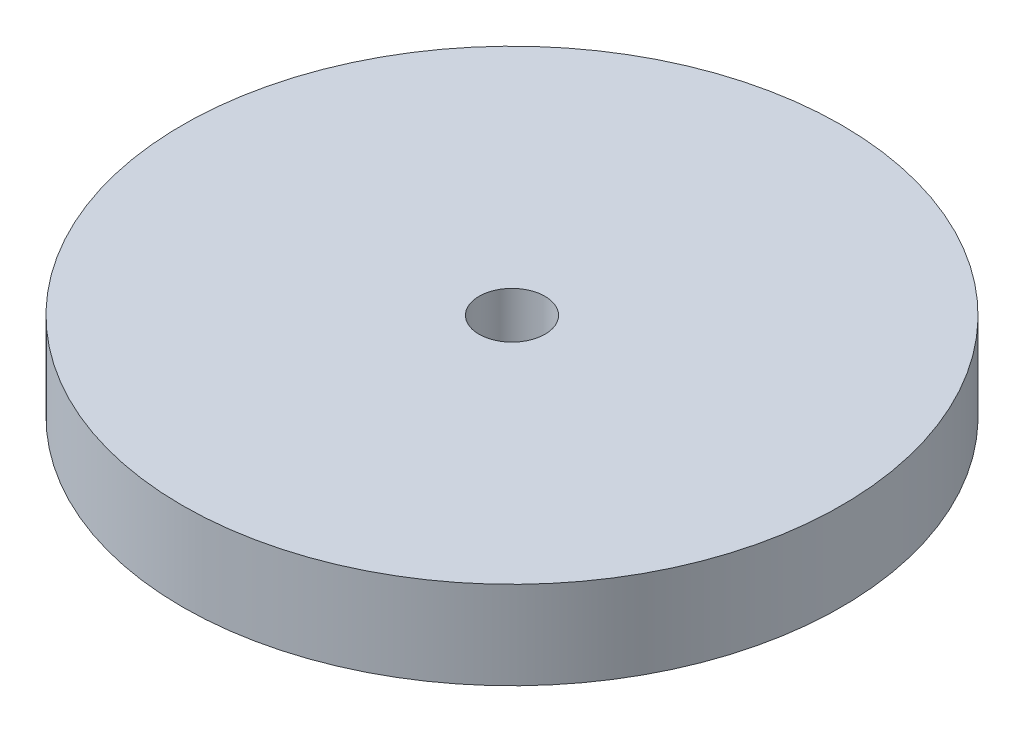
ISO-10303-21;
HEADER;
FILE_DESCRIPTION(('STEP AP214'),'2;1');
FILE_NAME('part.step','',(''),(''),'','','');
FILE_SCHEMA(('AUTOMOTIVE_DESIGN { 1 0 10303 214 1 1 1 1 }'));
ENDSEC;
DATA;
#1=APPLICATION_CONTEXT('core data for automotive mechanical design processes');
#2=APPLICATION_PROTOCOL_DEFINITION('international standard','automotive_design',2000,#1);
#3=PRODUCT_CONTEXT('',#1,'mechanical');
#4=PRODUCT('Part','Part','',(#3));
#5=PRODUCT_RELATED_PRODUCT_CATEGORY('part','',(#4));
#6=PRODUCT_DEFINITION_FORMATION('','',#4);
#7=PRODUCT_DEFINITION_CONTEXT('part definition',#1,'design');
#8=PRODUCT_DEFINITION('design','',#6,#7);
#9=PRODUCT_DEFINITION_SHAPE('','',#8);
#10=(LENGTH_UNIT() NAMED_UNIT(*) SI_UNIT(.MILLI.,.METRE.));
#11=(NAMED_UNIT(*) PLANE_ANGLE_UNIT() SI_UNIT($,.RADIAN.));
#12=(NAMED_UNIT(*) SI_UNIT($,.STERADIAN.) SOLID_ANGLE_UNIT());
#13=UNCERTAINTY_MEASURE_WITH_UNIT(LENGTH_MEASURE(1.E-05),#10,'distance_accuracy_value','');
#14=(GEOMETRIC_REPRESENTATION_CONTEXT(3) GLOBAL_UNCERTAINTY_ASSIGNED_CONTEXT((#13)) GLOBAL_UNIT_ASSIGNED_CONTEXT((#10,
#11,#12)) REPRESENTATION_CONTEXT('',''));
#15=CARTESIAN_POINT('',(0.,0.,0.));
#16=DIRECTION('',(0.,0.,1.));
#17=DIRECTION('',(1.,0.,0.));
#18=AXIS2_PLACEMENT_3D('',#15,#16,#17);
#19=CARTESIAN_POINT('',(0.,20.,0.));
#20=DIRECTION('',(0.,-1.,0.));
#21=DIRECTION('',(0.,0.,-1.));
#22=AXIS2_PLACEMENT_3D('',#19,#20,#21);
#23=CYLINDRICAL_SURFACE('',#22,75.);
#24=CARTESIAN_POINT('',(0.,20.,0.));
#25=DIRECTION('',(0.,1.,0.));
#26=DIRECTION('',(0.,0.,1.));
#27=AXIS2_PLACEMENT_3D('',#24,#25,#26);
#28=CIRCLE('',#27,75.);
#29=CARTESIAN_POINT('',(0.,20.,75.));
#30=VERTEX_POINT('',#29);
#31=EDGE_CURVE('E10',#30,#30,#28,.T.);
#32=ORIENTED_EDGE('',*,*,#31,.F.);
#33=EDGE_LOOP('',(#32));
#34=FACE_BOUND('',#33,.T.);
#35=CARTESIAN_POINT('',(0.,0.,0.));
#36=DIRECTION('',(0.,1.,0.));
#37=DIRECTION('',(0.,0.,1.));
#38=AXIS2_PLACEMENT_3D('',#35,#36,#37);
#39=CIRCLE('',#38,75.);
#40=CARTESIAN_POINT('',(0.,0.,75.));
#41=VERTEX_POINT('',#40);
#42=EDGE_CURVE('E36',#41,#41,#39,.T.);
#43=ORIENTED_EDGE('',*,*,#42,.T.);
#44=EDGE_LOOP('',(#43));
#45=FACE_BOUND('',#44,.T.);
#46=ADVANCED_FACE('F30',(#34,#45),#23,.T.);
#47=CARTESIAN_POINT('',(0.,20.,0.));
#48=DIRECTION('',(0.,1.,0.));
#49=DIRECTION('',(0.,0.,1.));
#50=AXIS2_PLACEMENT_3D('',#47,#48,#49);
#51=PLANE('',#50);
#52=CARTESIAN_POINT('',(0.,20.,0.));
#53=DIRECTION('',(0.,1.,0.));
#54=DIRECTION('',(0.,0.,1.));
#55=AXIS2_PLACEMENT_3D('',#52,#53,#54);
#56=CIRCLE('',#55,7.5);
#57=CARTESIAN_POINT('',(0.,20.,7.5));
#58=VERTEX_POINT('',#57);
#59=EDGE_CURVE('E44',#58,#58,#56,.T.);
#60=ORIENTED_EDGE('',*,*,#59,.F.);
#61=EDGE_LOOP('',(#60));
#62=FACE_BOUND('',#61,.T.);
#63=ORIENTED_EDGE('',*,*,#31,.T.);
#64=EDGE_LOOP('',(#63));
#65=FACE_BOUND('',#64,.T.);
#66=ADVANCED_FACE('F52',(#62,#65),#51,.T.);
#67=CARTESIAN_POINT('',(0.,0.,0.));
#68=DIRECTION('',(0.,1.,0.));
#69=DIRECTION('',(0.,0.,1.));
#70=AXIS2_PLACEMENT_3D('',#67,#68,#69);
#71=PLANE('',#70);
#72=CARTESIAN_POINT('',(0.,0.,0.));
#73=DIRECTION('',(0.,1.,0.));
#74=DIRECTION('',(0.,0.,1.));
#75=AXIS2_PLACEMENT_3D('',#72,#73,#74);
#76=CIRCLE('',#75,7.5);
#77=CARTESIAN_POINT('',(0.,0.,7.5));
#78=VERTEX_POINT('',#77);
#79=EDGE_CURVE('E40',#78,#78,#76,.T.);
#80=ORIENTED_EDGE('',*,*,#79,.T.);
#81=EDGE_LOOP('',(#80));
#82=FACE_BOUND('',#81,.T.);
#83=ORIENTED_EDGE('',*,*,#42,.F.);
#84=EDGE_LOOP('',(#83));
#85=FACE_BOUND('',#84,.T.);
#86=ADVANCED_FACE('F54',(#82,#85),#71,.F.);
#87=CARTESIAN_POINT('',(0.,0.,0.));
#88=DIRECTION('',(0.,1.,0.));
#89=DIRECTION('',(0.,0.,1.));
#90=AXIS2_PLACEMENT_3D('',#87,#88,#89);
#91=CYLINDRICAL_SURFACE('',#90,7.5);
#92=ORIENTED_EDGE('',*,*,#79,.F.);
#93=EDGE_LOOP('',(#92));
#94=FACE_BOUND('',#93,.T.);
#95=ORIENTED_EDGE('',*,*,#59,.T.);
#96=EDGE_LOOP('',(#95));
#97=FACE_BOUND('',#96,.T.);
#98=ADVANCED_FACE('F50',(#94,#97),#91,.F.);
#99=CLOSED_SHELL('',(#46,#66,#86,#98));
#100=MANIFOLD_SOLID_BREP('B2',#99);
#101=ADVANCED_BREP_SHAPE_REPRESENTATION('',(#18,#100),#14);
#102=SHAPE_DEFINITION_REPRESENTATION(#9,#101);
ENDSEC;
END-ISO-10303-21;
